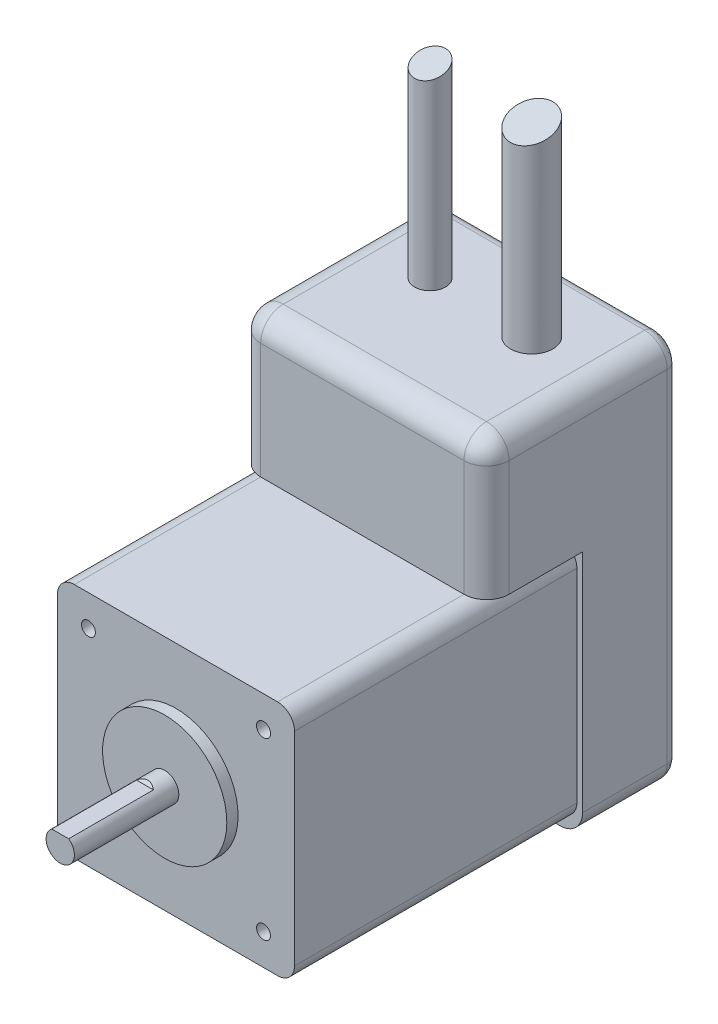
ISO-10303-21;
HEADER;
FILE_DESCRIPTION(('STEP AP214'),'2;1');
FILE_NAME('part.step','',(''),(''),'','','');
FILE_SCHEMA(('AUTOMOTIVE_DESIGN { 1 0 10303 214 1 1 1 1 }'));
ENDSEC;
DATA;
#1=APPLICATION_CONTEXT('core data for automotive mechanical design processes');
#2=APPLICATION_PROTOCOL_DEFINITION('international standard','automotive_design',2000,#1);
#3=PRODUCT_CONTEXT('',#1,'mechanical');
#4=PRODUCT('Part','Part','',(#3));
#5=PRODUCT_RELATED_PRODUCT_CATEGORY('part','',(#4));
#6=PRODUCT_DEFINITION_FORMATION('','',#4);
#7=PRODUCT_DEFINITION_CONTEXT('part definition',#1,'design');
#8=PRODUCT_DEFINITION('design','',#6,#7);
#9=PRODUCT_DEFINITION_SHAPE('','',#8);
#10=(LENGTH_UNIT() NAMED_UNIT(*) SI_UNIT(.MILLI.,.METRE.));
#11=(NAMED_UNIT(*) PLANE_ANGLE_UNIT() SI_UNIT($,.RADIAN.));
#12=(NAMED_UNIT(*) SI_UNIT($,.STERADIAN.) SOLID_ANGLE_UNIT());
#13=UNCERTAINTY_MEASURE_WITH_UNIT(LENGTH_MEASURE(1.E-05),#10,'distance_accuracy_value','');
#14=(GEOMETRIC_REPRESENTATION_CONTEXT(3) GLOBAL_UNCERTAINTY_ASSIGNED_CONTEXT((#13)) GLOBAL_UNIT_ASSIGNED_CONTEXT((#10,
#11,#12)) REPRESENTATION_CONTEXT('',''));
#15=CARTESIAN_POINT('',(0.,0.,0.));
#16=DIRECTION('',(0.,0.,1.));
#17=DIRECTION('',(1.,0.,0.));
#18=AXIS2_PLACEMENT_3D('',#15,#16,#17);
#19=CARTESIAN_POINT('',(3.5,2.,5.5));
#20=DIRECTION('',(0.,-0.707106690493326,-0.707106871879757));
#21=DIRECTION('',(0.,0.707106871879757,-0.707106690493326));
#22=AXIS2_PLACEMENT_3D('',#19,#20,#21);
#23=PLANE('',#22);
#24=DIRECTION('',(1.,0.,0.));
#25=VECTOR('',#24,1.);
#26=CARTESIAN_POINT('',(3.5,2.,5.5));
#27=LINE('',#26,#25);
#28=CARTESIAN_POINT('',(-1.5,2.,5.5));
#29=VERTEX_POINT('',#28);
#30=CARTESIAN_POINT('',(1.5,2.,5.5));
#31=VERTEX_POINT('',#30);
#32=EDGE_CURVE('E199',#29,#31,#27,.T.);
#33=ORIENTED_EDGE('',*,*,#32,.T.);
#34=CARTESIAN_POINT('',(0.,0.,7.49999948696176));
#35=DIRECTION('',(0.,-0.707106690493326,-0.707106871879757));
#36=DIRECTION('',(0.,-0.707106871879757,0.707106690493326));
#37=AXIS2_PLACEMENT_3D('',#34,#35,#36);
#38=ELLIPSE('',#37,3.53553345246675,2.5);
#39=EDGE_CURVE('E20',#29,#31,#38,.T.);
#40=ORIENTED_EDGE('',*,*,#39,.F.);
#41=EDGE_LOOP('',(#33,#40));
#42=FACE_BOUND('',#41,.T.);
#43=ADVANCED_FACE('F17',(#42),#23,.F.);
#44=CARTESIAN_POINT('',(3.5,2.,20.5));
#45=DIRECTION('',(0.,-1.,0.));
#46=DIRECTION('',(0.,0.,-1.));
#47=AXIS2_PLACEMENT_3D('',#44,#45,#46);
#48=PLANE('',#47);
#49=ORIENTED_EDGE('',*,*,#32,.F.);
#50=DIRECTION('',(0.,0.,1.));
#51=VECTOR('',#50,1.);
#52=CARTESIAN_POINT('',(-1.5,2.,2.));
#53=LINE('',#52,#51);
#54=CARTESIAN_POINT('',(-1.5,2.,20.5));
#55=VERTEX_POINT('',#54);
#56=EDGE_CURVE('E209',#55,#29,#53,.F.);
#57=ORIENTED_EDGE('',*,*,#56,.F.);
#58=DIRECTION('',(1.,0.,0.));
#59=VECTOR('',#58,1.);
#60=CARTESIAN_POINT('',(0.,2.,20.5));
#61=LINE('',#60,#59);
#62=CARTESIAN_POINT('',(1.5,2.,20.5));
#63=VERTEX_POINT('',#62);
#64=EDGE_CURVE('E211',#63,#55,#61,.F.);
#65=ORIENTED_EDGE('',*,*,#64,.F.);
#66=DIRECTION('',(0.,0.,1.));
#67=VECTOR('',#66,1.);
#68=CARTESIAN_POINT('',(1.5,2.,2.));
#69=LINE('',#68,#67);
#70=EDGE_CURVE('E207',#31,#63,#69,.T.);
#71=ORIENTED_EDGE('',*,*,#70,.F.);
#72=EDGE_LOOP('',(#49,#57,#65,#71));
#73=FACE_BOUND('',#72,.T.);
#74=ADVANCED_FACE('F213',(#73),#48,.F.);
#75=CARTESIAN_POINT('',(0.,0.,20.5));
#76=DIRECTION('',(0.,0.,1.));
#77=DIRECTION('',(1.,0.,0.));
#78=AXIS2_PLACEMENT_3D('',#75,#76,#77);
#79=PLANE('',#78);
#80=ORIENTED_EDGE('',*,*,#64,.T.);
#81=CARTESIAN_POINT('',(0.,0.,20.5));
#82=DIRECTION('',(0.,0.,1.));
#83=DIRECTION('',(1.,0.,0.));
#84=AXIS2_PLACEMENT_3D('',#81,#82,#83);
#85=CIRCLE('',#84,2.5);
#86=EDGE_CURVE('E215',#63,#55,#85,.F.);
#87=ORIENTED_EDGE('',*,*,#86,.F.);
#88=EDGE_LOOP('',(#80,#87));
#89=FACE_BOUND('',#88,.T.);
#90=ADVANCED_FACE('F313',(#89),#79,.T.);
#91=CARTESIAN_POINT('',(0.,0.,2.));
#92=DIRECTION('',(0.,0.,1.));
#93=DIRECTION('',(1.,0.,0.));
#94=AXIS2_PLACEMENT_3D('',#91,#92,#93);
#95=CYLINDRICAL_SURFACE('',#94,2.5);
#96=ORIENTED_EDGE('',*,*,#70,.T.);
#97=ORIENTED_EDGE('',*,*,#86,.T.);
#98=ORIENTED_EDGE('',*,*,#56,.T.);
#99=ORIENTED_EDGE('',*,*,#39,.T.);
#100=EDGE_LOOP('',(#96,#97,#98,#99));
#101=FACE_BOUND('',#100,.T.);
#102=CARTESIAN_POINT('',(0.,0.,2.));
#103=DIRECTION('',(0.,0.,1.));
#104=DIRECTION('',(1.,0.,0.));
#105=AXIS2_PLACEMENT_3D('',#102,#103,#104);
#106=CIRCLE('',#105,2.5);
#107=CARTESIAN_POINT('',(2.5,0.,2.));
#108=VERTEX_POINT('',#107);
#109=EDGE_CURVE('E217',#108,#108,#106,.F.);
#110=ORIENTED_EDGE('',*,*,#109,.F.);
#111=EDGE_LOOP('',(#110));
#112=FACE_BOUND('',#111,.T.);
#113=ADVANCED_FACE('F204',(#101,#112),#95,.T.);
#114=CARTESIAN_POINT('',(0.,0.,2.));
#115=DIRECTION('',(0.,0.,1.));
#116=DIRECTION('',(1.,0.,0.));
#117=AXIS2_PLACEMENT_3D('',#114,#115,#116);
#118=PLANE('',#117);
#119=CARTESIAN_POINT('',(0.,0.,2.));
#120=DIRECTION('',(0.,0.,1.));
#121=DIRECTION('',(1.,0.,0.));
#122=AXIS2_PLACEMENT_3D('',#119,#120,#121);
#123=CIRCLE('',#122,11.);
#124=CARTESIAN_POINT('',(11.,0.,2.));
#125=VERTEX_POINT('',#124);
#126=EDGE_CURVE('E304',#125,#125,#123,.F.);
#127=ORIENTED_EDGE('',*,*,#126,.F.);
#128=EDGE_LOOP('',(#127));
#129=FACE_BOUND('',#128,.T.);
#130=ORIENTED_EDGE('',*,*,#109,.T.);
#131=EDGE_LOOP('',(#130));
#132=FACE_BOUND('',#131,.T.);
#133=ADVANCED_FACE('F311',(#129,#132),#118,.T.);
#134=CARTESIAN_POINT('',(-15.5,15.5,-4.99999999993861));
#135=DIRECTION('',(0.,0.,1.));
#136=DIRECTION('',(1.,0.,0.));
#137=AXIS2_PLACEMENT_3D('',#134,#135,#136);
#138=CONICAL_SURFACE('',#137,1.22949999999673,1.02974425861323);
#139=CARTESIAN_POINT('',(-15.5,15.4999999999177,-5.73875813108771));
#140=VERTEX_POINT('',#139);
#141=VERTEX_LOOP('',#140);
#142=FACE_BOUND('',#141,.T.);
#143=CARTESIAN_POINT('',(-15.5,15.5,-5.));
#144=DIRECTION('',(0.,0.,-1.));
#145=DIRECTION('',(-1.,0.,0.));
#146=AXIS2_PLACEMENT_3D('',#143,#144,#145);
#147=CIRCLE('',#146,1.2295);
#148=CARTESIAN_POINT('',(-16.7295,15.5,-5.));
#149=VERTEX_POINT('',#148);
#150=EDGE_CURVE('E307',#149,#149,#147,.F.);
#151=ORIENTED_EDGE('',*,*,#150,.T.);
#152=EDGE_LOOP('',(#151));
#153=FACE_BOUND('',#152,.T.);
#154=ADVANCED_FACE('F320',(#142,#153),#138,.F.);
#155=CARTESIAN_POINT('',(-15.5,-15.5,-4.99999999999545));
#156=DIRECTION('',(0.,0.,1.));
#157=DIRECTION('',(1.,0.,0.));
#158=AXIS2_PLACEMENT_3D('',#155,#156,#157);
#159=CONICAL_SURFACE('',#158,1.22949999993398,1.02974425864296);
#160=CARTESIAN_POINT('',(-15.5,-15.5000000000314,-5.73875813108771));
#161=VERTEX_POINT('',#160);
#162=VERTEX_LOOP('',#161);
#163=FACE_BOUND('',#162,.T.);
#164=CARTESIAN_POINT('',(-15.5,-15.5,-5.));
#165=DIRECTION('',(0.,0.,-1.));
#166=DIRECTION('',(-1.,0.,0.));
#167=AXIS2_PLACEMENT_3D('',#164,#165,#166);
#168=CIRCLE('',#167,1.2295);
#169=CARTESIAN_POINT('',(-16.7295,-15.5,-5.));
#170=VERTEX_POINT('',#169);
#171=EDGE_CURVE('E680',#170,#170,#168,.F.);
#172=ORIENTED_EDGE('',*,*,#171,.T.);
#173=EDGE_LOOP('',(#172));
#174=FACE_BOUND('',#173,.T.);
#175=ADVANCED_FACE('F715',(#163,#174),#159,.F.);
#176=CARTESIAN_POINT('',(15.5,-15.5,-4.99999999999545));
#177=DIRECTION('',(0.,0.,1.));
#178=DIRECTION('',(1.,0.,0.));
#179=AXIS2_PLACEMENT_3D('',#176,#177,#178);
#180=CONICAL_SURFACE('',#179,1.22949999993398,1.02974425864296);
#181=CARTESIAN_POINT('',(15.5,-15.5000000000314,-5.73875813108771));
#182=VERTEX_POINT('',#181);
#183=VERTEX_LOOP('',#182);
#184=FACE_BOUND('',#183,.T.);
#185=CARTESIAN_POINT('',(15.5,-15.5,-5.));
#186=DIRECTION('',(0.,0.,-1.));
#187=DIRECTION('',(-1.,0.,0.));
#188=AXIS2_PLACEMENT_3D('',#185,#186,#187);
#189=CIRCLE('',#188,1.2295);
#190=CARTESIAN_POINT('',(14.2705,-15.5,-5.));
#191=VERTEX_POINT('',#190);
#192=EDGE_CURVE('E675',#191,#191,#189,.F.);
#193=ORIENTED_EDGE('',*,*,#192,.T.);
#194=EDGE_LOOP('',(#193));
#195=FACE_BOUND('',#194,.T.);
#196=ADVANCED_FACE('F711',(#184,#195),#180,.F.);
#197=CARTESIAN_POINT('',(15.5,15.5,-4.99999999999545));
#198=DIRECTION('',(0.,0.,1.));
#199=DIRECTION('',(1.,0.,0.));
#200=AXIS2_PLACEMENT_3D('',#197,#198,#199);
#201=CONICAL_SURFACE('',#200,1.25000000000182,1.02974425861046);
#202=CARTESIAN_POINT('',(15.5,15.4999999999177,-5.75107577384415));
#203=VERTEX_POINT('',#202);
#204=VERTEX_LOOP('',#203);
#205=FACE_BOUND('',#204,.T.);
#206=CARTESIAN_POINT('',(15.5,15.5,-5.));
#207=DIRECTION('',(0.,0.,-1.));
#208=DIRECTION('',(-1.,0.,0.));
#209=AXIS2_PLACEMENT_3D('',#206,#207,#208);
#210=CIRCLE('',#209,1.25);
#211=CARTESIAN_POINT('',(14.25,15.5,-5.));
#212=VERTEX_POINT('',#211);
#213=EDGE_CURVE('E303',#212,#212,#210,.F.);
#214=ORIENTED_EDGE('',*,*,#213,.T.);
#215=EDGE_LOOP('',(#214));
#216=FACE_BOUND('',#215,.T.);
#217=ADVANCED_FACE('F703',(#205,#216),#201,.F.);
#218=CARTESIAN_POINT('',(0.,0.,0.));
#219=DIRECTION('',(0.,0.,1.));
#220=DIRECTION('',(1.,0.,0.));
#221=AXIS2_PLACEMENT_3D('',#218,#219,#220);
#222=CYLINDRICAL_SURFACE('',#221,11.);
#223=CARTESIAN_POINT('',(0.,0.,0.));
#224=DIRECTION('',(0.,0.,1.));
#225=DIRECTION('',(1.,0.,0.));
#226=AXIS2_PLACEMENT_3D('',#223,#224,#225);
#227=CIRCLE('',#226,11.);
#228=CARTESIAN_POINT('',(11.,0.,0.));
#229=VERTEX_POINT('',#228);
#230=EDGE_CURVE('E300',#229,#229,#227,.F.);
#231=ORIENTED_EDGE('',*,*,#230,.F.);
#232=EDGE_LOOP('',(#231));
#233=FACE_BOUND('',#232,.T.);
#234=ORIENTED_EDGE('',*,*,#126,.T.);
#235=EDGE_LOOP('',(#234));
#236=FACE_BOUND('',#235,.T.);
#237=ADVANCED_FACE('F693',(#233,#236),#222,.T.);
#238=CARTESIAN_POINT('',(-15.5,15.5,0.));
#239=DIRECTION('',(0.,0.,-1.));
#240=DIRECTION('',(-1.,0.,0.));
#241=AXIS2_PLACEMENT_3D('',#238,#239,#240);
#242=CYLINDRICAL_SURFACE('',#241,1.2295);
#243=CARTESIAN_POINT('',(-15.5,15.5,0.));
#244=DIRECTION('',(0.,0.,-1.));
#245=DIRECTION('',(-1.,0.,0.));
#246=AXIS2_PLACEMENT_3D('',#243,#244,#245);
#247=CIRCLE('',#246,1.2295);
#248=CARTESIAN_POINT('',(-16.7295,15.5,0.));
#249=VERTEX_POINT('',#248);
#250=EDGE_CURVE('E297',#249,#249,#247,.T.);
#251=ORIENTED_EDGE('',*,*,#250,.F.);
#252=EDGE_LOOP('',(#251));
#253=FACE_BOUND('',#252,.T.);
#254=ORIENTED_EDGE('',*,*,#150,.F.);
#255=EDGE_LOOP('',(#254));
#256=FACE_BOUND('',#255,.T.);
#257=ADVANCED_FACE('F690',(#253,#256),#242,.F.);
#258=CARTESIAN_POINT('',(-15.5,-15.5,0.));
#259=DIRECTION('',(0.,0.,-1.));
#260=DIRECTION('',(-1.,0.,0.));
#261=AXIS2_PLACEMENT_3D('',#258,#259,#260);
#262=CYLINDRICAL_SURFACE('',#261,1.2295);
#263=CARTESIAN_POINT('',(-15.5,-15.5,0.));
#264=DIRECTION('',(0.,0.,-1.));
#265=DIRECTION('',(-1.,0.,0.));
#266=AXIS2_PLACEMENT_3D('',#263,#264,#265);
#267=CIRCLE('',#266,1.2295);
#268=CARTESIAN_POINT('',(-16.7295,-15.5,0.));
#269=VERTEX_POINT('',#268);
#270=EDGE_CURVE('E294',#269,#269,#267,.T.);
#271=ORIENTED_EDGE('',*,*,#270,.F.);
#272=EDGE_LOOP('',(#271));
#273=FACE_BOUND('',#272,.T.);
#274=ORIENTED_EDGE('',*,*,#171,.F.);
#275=EDGE_LOOP('',(#274));
#276=FACE_BOUND('',#275,.T.);
#277=ADVANCED_FACE('F692',(#273,#276),#262,.F.);
#278=CARTESIAN_POINT('',(15.5,-15.5,0.));
#279=DIRECTION('',(0.,0.,-1.));
#280=DIRECTION('',(-1.,0.,0.));
#281=AXIS2_PLACEMENT_3D('',#278,#279,#280);
#282=CYLINDRICAL_SURFACE('',#281,1.2295);
#283=CARTESIAN_POINT('',(15.5,-15.5,0.));
#284=DIRECTION('',(0.,0.,-1.));
#285=DIRECTION('',(-1.,0.,0.));
#286=AXIS2_PLACEMENT_3D('',#283,#284,#285);
#287=CIRCLE('',#286,1.2295);
#288=CARTESIAN_POINT('',(14.2705,-15.5,0.));
#289=VERTEX_POINT('',#288);
#290=EDGE_CURVE('E291',#289,#289,#287,.T.);
#291=ORIENTED_EDGE('',*,*,#290,.F.);
#292=EDGE_LOOP('',(#291));
#293=FACE_BOUND('',#292,.T.);
#294=ORIENTED_EDGE('',*,*,#192,.F.);
#295=EDGE_LOOP('',(#294));
#296=FACE_BOUND('',#295,.T.);
#297=ADVANCED_FACE('F700',(#293,#296),#282,.F.);
#298=CARTESIAN_POINT('',(15.5,15.5,0.));
#299=DIRECTION('',(0.,0.,-1.));
#300=DIRECTION('',(-1.,0.,0.));
#301=AXIS2_PLACEMENT_3D('',#298,#299,#300);
#302=CYLINDRICAL_SURFACE('',#301,1.25);
#303=CARTESIAN_POINT('',(15.5,15.5,0.));
#304=DIRECTION('',(0.,0.,-1.));
#305=DIRECTION('',(-1.,0.,0.));
#306=AXIS2_PLACEMENT_3D('',#303,#304,#305);
#307=CIRCLE('',#306,1.25);
#308=CARTESIAN_POINT('',(14.25,15.5,0.));
#309=VERTEX_POINT('',#308);
#310=EDGE_CURVE('E287',#309,#309,#307,.T.);
#311=ORIENTED_EDGE('',*,*,#310,.F.);
#312=EDGE_LOOP('',(#311));
#313=FACE_BOUND('',#312,.T.);
#314=ORIENTED_EDGE('',*,*,#213,.F.);
#315=EDGE_LOOP('',(#314));
#316=FACE_BOUND('',#315,.T.);
#317=ADVANCED_FACE('F760',(#313,#316),#302,.F.);
#318=CARTESIAN_POINT('',(0.,0.,0.));
#319=DIRECTION('',(0.,0.,1.));
#320=DIRECTION('',(1.,0.,0.));
#321=AXIS2_PLACEMENT_3D('',#318,#319,#320);
#322=PLANE('',#321);
#323=DIRECTION('',(1.,0.,0.));
#324=VECTOR('',#323,1.);
#325=CARTESIAN_POINT('',(18.,21.,0.));
#326=LINE('',#325,#324);
#327=CARTESIAN_POINT('',(-18.,21.,0.));
#328=VERTEX_POINT('',#327);
#329=CARTESIAN_POINT('',(18.,21.,0.));
#330=VERTEX_POINT('',#329);
#331=EDGE_CURVE('E290',#328,#330,#326,.T.);
#332=ORIENTED_EDGE('',*,*,#331,.F.);
#333=CARTESIAN_POINT('',(-18.,18.,0.));
#334=DIRECTION('',(0.,0.,-1.));
#335=DIRECTION('',(-1.,0.,0.));
#336=AXIS2_PLACEMENT_3D('',#333,#334,#335);
#337=CIRCLE('',#336,3.);
#338=CARTESIAN_POINT('',(-21.,18.,0.));
#339=VERTEX_POINT('',#338);
#340=EDGE_CURVE('E271',#339,#328,#337,.T.);
#341=ORIENTED_EDGE('',*,*,#340,.F.);
#342=DIRECTION('',(0.,1.,0.));
#343=VECTOR('',#342,1.);
#344=CARTESIAN_POINT('',(-21.,18.,0.));
#345=LINE('',#344,#343);
#346=CARTESIAN_POINT('',(-21.,-18.,0.));
#347=VERTEX_POINT('',#346);
#348=EDGE_CURVE('E648',#347,#339,#345,.T.);
#349=ORIENTED_EDGE('',*,*,#348,.F.);
#350=CARTESIAN_POINT('',(-18.,-18.,0.));
#351=DIRECTION('',(0.,0.,-1.));
#352=DIRECTION('',(-1.,0.,0.));
#353=AXIS2_PLACEMENT_3D('',#350,#351,#352);
#354=CIRCLE('',#353,3.);
#355=CARTESIAN_POINT('',(-18.,-21.,0.));
#356=VERTEX_POINT('',#355);
#357=EDGE_CURVE('E275',#356,#347,#354,.T.);
#358=ORIENTED_EDGE('',*,*,#357,.F.);
#359=DIRECTION('',(1.,0.,0.));
#360=VECTOR('',#359,1.);
#361=CARTESIAN_POINT('',(-18.,-21.,0.));
#362=LINE('',#361,#360);
#363=CARTESIAN_POINT('',(18.,-21.,0.));
#364=VERTEX_POINT('',#363);
#365=EDGE_CURVE('E653',#364,#356,#362,.F.);
#366=ORIENTED_EDGE('',*,*,#365,.F.);
#367=CARTESIAN_POINT('',(18.,-18.,0.));
#368=DIRECTION('',(0.,0.,-1.));
#369=DIRECTION('',(-1.,0.,0.));
#370=AXIS2_PLACEMENT_3D('',#367,#368,#369);
#371=CIRCLE('',#370,3.);
#372=CARTESIAN_POINT('',(21.,-18.,0.));
#373=VERTEX_POINT('',#372);
#374=EDGE_CURVE('E279',#373,#364,#371,.T.);
#375=ORIENTED_EDGE('',*,*,#374,.F.);
#376=DIRECTION('',(0.,1.,0.));
#377=VECTOR('',#376,1.);
#378=CARTESIAN_POINT('',(21.,-18.,0.));
#379=LINE('',#378,#377);
#380=CARTESIAN_POINT('',(21.,18.,0.));
#381=VERTEX_POINT('',#380);
#382=EDGE_CURVE('E658',#381,#373,#379,.F.);
#383=ORIENTED_EDGE('',*,*,#382,.F.);
#384=CARTESIAN_POINT('',(18.,18.,0.));
#385=DIRECTION('',(0.,0.,-1.));
#386=DIRECTION('',(-1.,0.,0.));
#387=AXIS2_PLACEMENT_3D('',#384,#385,#386);
#388=CIRCLE('',#387,3.);
#389=EDGE_CURVE('E283',#330,#381,#388,.T.);
#390=ORIENTED_EDGE('',*,*,#389,.F.);
#391=EDGE_LOOP('',(#332,#341,#349,#358,#366,#375,#383,#390));
#392=FACE_BOUND('',#391,.T.);
#393=ORIENTED_EDGE('',*,*,#310,.T.);
#394=EDGE_LOOP('',(#393));
#395=FACE_BOUND('',#394,.T.);
#396=ORIENTED_EDGE('',*,*,#290,.T.);
#397=EDGE_LOOP('',(#396));
#398=FACE_BOUND('',#397,.T.);
#399=ORIENTED_EDGE('',*,*,#270,.T.);
#400=EDGE_LOOP('',(#399));
#401=FACE_BOUND('',#400,.T.);
#402=ORIENTED_EDGE('',*,*,#250,.T.);
#403=EDGE_LOOP('',(#402));
#404=FACE_BOUND('',#403,.T.);
#405=ORIENTED_EDGE('',*,*,#230,.T.);
#406=EDGE_LOOP('',(#405));
#407=FACE_BOUND('',#406,.T.);
#408=ADVANCED_FACE('F767',(#392,#395,#398,#401,#404,#407),#322,.T.);
#409=CARTESIAN_POINT('',(18.,21.,0.));
#410=DIRECTION('',(0.,1.,0.));
#411=DIRECTION('',(0.,0.,1.));
#412=AXIS2_PLACEMENT_3D('',#409,#410,#411);
#413=PLANE('',#412);
#414=ORIENTED_EDGE('',*,*,#331,.T.);
#415=DIRECTION('',(0.,0.,-1.));
#416=VECTOR('',#415,1.);
#417=CARTESIAN_POINT('',(18.,21.,0.));
#418=LINE('',#417,#416);
#419=CARTESIAN_POINT('',(18.,21.,-33.));
#420=VERTEX_POINT('',#419);
#421=EDGE_CURVE('E286',#420,#330,#418,.F.);
#422=ORIENTED_EDGE('',*,*,#421,.F.);
#423=DIRECTION('',(1.,0.,0.));
#424=VECTOR('',#423,1.);
#425=CARTESIAN_POINT('',(0.,21.,-33.));
#426=LINE('',#425,#424);
#427=CARTESIAN_POINT('',(-18.,21.,-33.));
#428=VERTEX_POINT('',#427);
#429=EDGE_CURVE('E663',#428,#420,#426,.T.);
#430=ORIENTED_EDGE('',*,*,#429,.F.);
#431=DIRECTION('',(0.,0.,-1.));
#432=VECTOR('',#431,1.);
#433=CARTESIAN_POINT('',(-18.,21.,0.));
#434=LINE('',#433,#432);
#435=EDGE_CURVE('E273',#328,#428,#434,.T.);
#436=ORIENTED_EDGE('',*,*,#435,.F.);
#437=EDGE_LOOP('',(#414,#422,#430,#436));
#438=FACE_BOUND('',#437,.T.);
#439=ADVANCED_FACE('F775',(#438),#413,.T.);
#440=CARTESIAN_POINT('',(18.,18.,0.));
#441=DIRECTION('',(0.,0.,-1.));
#442=DIRECTION('',(-1.,0.,0.));
#443=AXIS2_PLACEMENT_3D('',#440,#441,#442);
#444=CYLINDRICAL_SURFACE('',#443,3.);
#445=ORIENTED_EDGE('',*,*,#389,.T.);
#446=DIRECTION('',(0.,0.,-1.));
#447=VECTOR('',#446,1.);
#448=CARTESIAN_POINT('',(21.,18.,0.));
#449=LINE('',#448,#447);
#450=CARTESIAN_POINT('',(21.,18.,-50.));
#451=VERTEX_POINT('',#450);
#452=EDGE_CURVE('E285',#451,#381,#449,.F.);
#453=ORIENTED_EDGE('',*,*,#452,.F.);
#454=CARTESIAN_POINT('',(18.,18.,-50.));
#455=DIRECTION('',(0.,0.,-1.));
#456=DIRECTION('',(-1.,0.,0.));
#457=AXIS2_PLACEMENT_3D('',#454,#455,#456);
#458=CIRCLE('',#457,3.);
#459=CARTESIAN_POINT('',(18.,21.,-50.));
#460=VERTEX_POINT('',#459);
#461=EDGE_CURVE('E258',#460,#451,#458,.T.);
#462=ORIENTED_EDGE('',*,*,#461,.F.);
#463=DIRECTION('',(0.,0.,-1.));
#464=VECTOR('',#463,1.);
#465=CARTESIAN_POINT('',(18.,21.,-50.));
#466=LINE('',#465,#464);
#467=EDGE_CURVE('E264',#420,#460,#466,.T.);
#468=ORIENTED_EDGE('',*,*,#467,.F.);
#469=ORIENTED_EDGE('',*,*,#421,.T.);
#470=EDGE_LOOP('',(#445,#453,#462,#468,#469));
#471=FACE_BOUND('',#470,.T.);
#472=ADVANCED_FACE('F783',(#471),#444,.T.);
#473=CARTESIAN_POINT('',(21.,-18.,0.));
#474=DIRECTION('',(1.,0.,0.));
#475=DIRECTION('',(0.,0.,-1.));
#476=AXIS2_PLACEMENT_3D('',#473,#474,#475);
#477=PLANE('',#476);
#478=ORIENTED_EDGE('',*,*,#382,.T.);
#479=DIRECTION('',(0.,0.,-1.));
#480=VECTOR('',#479,1.);
#481=CARTESIAN_POINT('',(21.,-18.,0.));
#482=LINE('',#481,#480);
#483=CARTESIAN_POINT('',(21.,-18.,-50.));
#484=VERTEX_POINT('',#483);
#485=EDGE_CURVE('E282',#484,#373,#482,.F.);
#486=ORIENTED_EDGE('',*,*,#485,.F.);
#487=DIRECTION('',(0.,1.,0.));
#488=VECTOR('',#487,1.);
#489=CARTESIAN_POINT('',(21.,11.25,-50.));
#490=LINE('',#489,#488);
#491=EDGE_CURVE('E257',#451,#484,#490,.F.);
#492=ORIENTED_EDGE('',*,*,#491,.F.);
#493=ORIENTED_EDGE('',*,*,#452,.T.);
#494=EDGE_LOOP('',(#478,#486,#492,#493));
#495=FACE_BOUND('',#494,.T.);
#496=ADVANCED_FACE('F791',(#495),#477,.T.);
#497=CARTESIAN_POINT('',(18.,-18.,0.));
#498=DIRECTION('',(0.,0.,-1.));
#499=DIRECTION('',(-1.,0.,0.));
#500=AXIS2_PLACEMENT_3D('',#497,#498,#499);
#501=CYLINDRICAL_SURFACE('',#500,3.);
#502=ORIENTED_EDGE('',*,*,#374,.T.);
#503=DIRECTION('',(0.,0.,-1.));
#504=VECTOR('',#503,1.);
#505=CARTESIAN_POINT('',(18.,-21.,0.));
#506=LINE('',#505,#504);
#507=CARTESIAN_POINT('',(18.,-21.,-50.));
#508=VERTEX_POINT('',#507);
#509=EDGE_CURVE('E281',#508,#364,#506,.F.);
#510=ORIENTED_EDGE('',*,*,#509,.F.);
#511=CARTESIAN_POINT('',(18.,-18.,-50.));
#512=DIRECTION('',(0.,0.,-1.));
#513=DIRECTION('',(-1.,0.,0.));
#514=AXIS2_PLACEMENT_3D('',#511,#512,#513);
#515=CIRCLE('',#514,3.);
#516=EDGE_CURVE('E255',#484,#508,#515,.T.);
#517=ORIENTED_EDGE('',*,*,#516,.F.);
#518=ORIENTED_EDGE('',*,*,#485,.T.);
#519=EDGE_LOOP('',(#502,#510,#517,#518));
#520=FACE_BOUND('',#519,.T.);
#521=ADVANCED_FACE('F799',(#520),#501,.T.);
#522=CARTESIAN_POINT('',(-18.,-21.,0.));
#523=DIRECTION('',(0.,-1.,0.));
#524=DIRECTION('',(0.,0.,-1.));
#525=AXIS2_PLACEMENT_3D('',#522,#523,#524);
#526=PLANE('',#525);
#527=ORIENTED_EDGE('',*,*,#365,.T.);
#528=DIRECTION('',(0.,0.,-1.));
#529=VECTOR('',#528,1.);
#530=CARTESIAN_POINT('',(-18.,-21.,0.));
#531=LINE('',#530,#529);
#532=CARTESIAN_POINT('',(-18.,-21.,-50.));
#533=VERTEX_POINT('',#532);
#534=EDGE_CURVE('E278',#533,#356,#531,.F.);
#535=ORIENTED_EDGE('',*,*,#534,.F.);
#536=DIRECTION('',(1.,0.,0.));
#537=VECTOR('',#536,1.);
#538=CARTESIAN_POINT('',(0.,-21.,-50.));
#539=LINE('',#538,#537);
#540=EDGE_CURVE('E254',#508,#533,#539,.F.);
#541=ORIENTED_EDGE('',*,*,#540,.F.);
#542=ORIENTED_EDGE('',*,*,#509,.T.);
#543=EDGE_LOOP('',(#527,#535,#541,#542));
#544=FACE_BOUND('',#543,.T.);
#545=ADVANCED_FACE('F807',(#544),#526,.T.);
#546=CARTESIAN_POINT('',(-18.,-18.,0.));
#547=DIRECTION('',(0.,0.,-1.));
#548=DIRECTION('',(-1.,0.,0.));
#549=AXIS2_PLACEMENT_3D('',#546,#547,#548);
#550=CYLINDRICAL_SURFACE('',#549,3.);
#551=ORIENTED_EDGE('',*,*,#357,.T.);
#552=DIRECTION('',(0.,0.,1.));
#553=VECTOR('',#552,1.);
#554=CARTESIAN_POINT('',(-21.,-18.,0.));
#555=LINE('',#554,#553);
#556=CARTESIAN_POINT('',(-21.,-18.,-50.));
#557=VERTEX_POINT('',#556);
#558=EDGE_CURVE('E277',#557,#347,#555,.T.);
#559=ORIENTED_EDGE('',*,*,#558,.F.);
#560=CARTESIAN_POINT('',(-18.,-18.,-50.));
#561=DIRECTION('',(0.,0.,-1.));
#562=DIRECTION('',(-1.,0.,0.));
#563=AXIS2_PLACEMENT_3D('',#560,#561,#562);
#564=CIRCLE('',#563,3.);
#565=EDGE_CURVE('E252',#533,#557,#564,.T.);
#566=ORIENTED_EDGE('',*,*,#565,.F.);
#567=ORIENTED_EDGE('',*,*,#534,.T.);
#568=EDGE_LOOP('',(#551,#559,#566,#567));
#569=FACE_BOUND('',#568,.T.);
#570=ADVANCED_FACE('F815',(#569),#550,.T.);
#571=CARTESIAN_POINT('',(-21.,18.,0.));
#572=DIRECTION('',(-1.,0.,0.));
#573=DIRECTION('',(0.,0.,1.));
#574=AXIS2_PLACEMENT_3D('',#571,#572,#573);
#575=PLANE('',#574);
#576=ORIENTED_EDGE('',*,*,#348,.T.);
#577=DIRECTION('',(0.,0.,-1.));
#578=VECTOR('',#577,1.);
#579=CARTESIAN_POINT('',(-21.,18.,0.));
#580=LINE('',#579,#578);
#581=CARTESIAN_POINT('',(-21.,18.,-50.));
#582=VERTEX_POINT('',#581);
#583=EDGE_CURVE('E274',#582,#339,#580,.F.);
#584=ORIENTED_EDGE('',*,*,#583,.F.);
#585=DIRECTION('',(0.,1.,0.));
#586=VECTOR('',#585,1.);
#587=CARTESIAN_POINT('',(-21.,11.25,-50.));
#588=LINE('',#587,#586);
#589=EDGE_CURVE('E251',#557,#582,#588,.T.);
#590=ORIENTED_EDGE('',*,*,#589,.F.);
#591=ORIENTED_EDGE('',*,*,#558,.T.);
#592=EDGE_LOOP('',(#576,#584,#590,#591));
#593=FACE_BOUND('',#592,.T.);
#594=ADVANCED_FACE('F823',(#593),#575,.T.);
#595=CARTESIAN_POINT('',(-18.,18.,0.));
#596=DIRECTION('',(0.,0.,-1.));
#597=DIRECTION('',(-1.,0.,0.));
#598=AXIS2_PLACEMENT_3D('',#595,#596,#597);
#599=CYLINDRICAL_SURFACE('',#598,3.);
#600=ORIENTED_EDGE('',*,*,#435,.T.);
#601=DIRECTION('',(0.,0.,-1.));
#602=VECTOR('',#601,1.);
#603=CARTESIAN_POINT('',(-18.,21.,-50.));
#604=LINE('',#603,#602);
#605=CARTESIAN_POINT('',(-18.,21.,-50.));
#606=VERTEX_POINT('',#605);
#607=EDGE_CURVE('E270',#606,#428,#604,.F.);
#608=ORIENTED_EDGE('',*,*,#607,.F.);
#609=CARTESIAN_POINT('',(-18.,18.,-50.));
#610=DIRECTION('',(0.,0.,-1.));
#611=DIRECTION('',(-1.,0.,0.));
#612=AXIS2_PLACEMENT_3D('',#609,#610,#611);
#613=CIRCLE('',#612,3.);
#614=EDGE_CURVE('E248',#582,#606,#613,.T.);
#615=ORIENTED_EDGE('',*,*,#614,.F.);
#616=ORIENTED_EDGE('',*,*,#583,.T.);
#617=ORIENTED_EDGE('',*,*,#340,.T.);
#618=EDGE_LOOP('',(#600,#608,#615,#616,#617));
#619=FACE_BOUND('',#618,.T.);
#620=ADVANCED_FACE('F831',(#619),#599,.T.);
#621=CARTESIAN_POINT('',(0.,33.25,-33.));
#622=DIRECTION('',(0.,0.,1.));
#623=DIRECTION('',(1.,0.,0.));
#624=AXIS2_PLACEMENT_3D('',#621,#622,#623);
#625=PLANE('',#624);
#626=DIRECTION('',(0.,1.,0.));
#627=VECTOR('',#626,1.);
#628=CARTESIAN_POINT('',(-18.,37.375,-33.));
#629=LINE('',#628,#627);
#630=CARTESIAN_POINT('',(-18.,41.5,-33.));
#631=VERTEX_POINT('',#630);
#632=EDGE_CURVE('E269',#428,#631,#629,.T.);
#633=ORIENTED_EDGE('',*,*,#632,.F.);
#634=ORIENTED_EDGE('',*,*,#429,.T.);
#635=DIRECTION('',(0.,-1.,0.));
#636=VECTOR('',#635,1.);
#637=CARTESIAN_POINT('',(18.,7.125,-33.));
#638=LINE('',#637,#636);
#639=CARTESIAN_POINT('',(18.,41.5,-33.));
#640=VERTEX_POINT('',#639);
#641=EDGE_CURVE('E265',#640,#420,#638,.T.);
#642=ORIENTED_EDGE('',*,*,#641,.F.);
#643=DIRECTION('',(1.,0.,0.));
#644=VECTOR('',#643,1.);
#645=CARTESIAN_POINT('',(9.,41.5,-33.));
#646=LINE('',#645,#644);
#647=EDGE_CURVE('E247',#631,#640,#646,.T.);
#648=ORIENTED_EDGE('',*,*,#647,.F.);
#649=EDGE_LOOP('',(#633,#634,#642,#648));
#650=FACE_BOUND('',#649,.T.);
#651=ADVANCED_FACE('F839',(#650),#625,.T.);
#652=CARTESIAN_POINT('',(-14.,80.9445648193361,-61.5566444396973));
#653=DIRECTION('',(0.,-0.948683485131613,-0.316227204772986));
#654=DIRECTION('',(0.,0.316227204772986,-0.948683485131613));
#655=AXIS2_PLACEMENT_3D('',#652,#653,#654);
#656=PLANE('',#655);
#657=CARTESIAN_POINT('',(-9.00000000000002,78.4256883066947,-54.));
#658=DIRECTION('',(0.,-0.948683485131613,-0.316227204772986));
#659=DIRECTION('',(0.,0.316227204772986,-0.948683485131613));
#660=AXIS2_PLACEMENT_3D('',#657,#658,#659);
#661=ELLIPSE('',#660,2.89875395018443,2.75);
#662=CARTESIAN_POINT('',(-9.00000000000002,79.3423531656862,-56.75));
#663=VERTEX_POINT('',#662);
#664=EDGE_CURVE('E244',#663,#663,#661,.T.);
#665=ORIENTED_EDGE('',*,*,#664,.F.);
#666=EDGE_LOOP('',(#665));
#667=FACE_BOUND('',#666,.T.);
#668=ADVANCED_FACE('F847',(#667),#656,.F.);
#669=CARTESIAN_POINT('',(-14.,80.9445648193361,-61.5566444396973));
#670=DIRECTION('',(0.,-0.948683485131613,-0.316227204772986));
#671=DIRECTION('',(0.,0.316227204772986,-0.948683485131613));
#672=AXIS2_PLACEMENT_3D('',#669,#670,#671);
#673=PLANE('',#672);
#674=CARTESIAN_POINT('',(8.99999999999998,78.4256883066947,-54.));
#675=DIRECTION('',(0.,-0.948683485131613,-0.316227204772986));
#676=DIRECTION('',(0.,0.316227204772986,-0.948683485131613));
#677=AXIS2_PLACEMENT_3D('',#674,#675,#676);
#678=ELLIPSE('',#677,3.95284629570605,3.75);
#679=CARTESIAN_POINT('',(8.99999999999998,79.6756858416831,-57.75));
#680=VERTEX_POINT('',#679);
#681=EDGE_CURVE('E240',#680,#680,#678,.T.);
#682=ORIENTED_EDGE('',*,*,#681,.F.);
#683=EDGE_LOOP('',(#682));
#684=FACE_BOUND('',#683,.T.);
#685=ADVANCED_FACE('F629',(#684),#673,.F.);
#686=CARTESIAN_POINT('',(-18.,41.5,-37.));
#687=DIRECTION('',(1.,0.,0.));
#688=DIRECTION('',(0.,1.,0.));
#689=AXIS2_PLACEMENT_3D('',#686,#687,#688);
#690=SPHERICAL_SURFACE('',#689,4.);
#691=CARTESIAN_POINT('',(-18.,41.5,-37.));
#692=DIRECTION('',(1.,0.,0.));
#693=DIRECTION('',(0.,1.,0.));
#694=AXIS2_PLACEMENT_3D('',#691,#692,#693);
#695=CIRCLE('',#694,4.);
#696=CARTESIAN_POINT('',(-18.,45.5,-37.));
#697=VERTEX_POINT('',#696);
#698=EDGE_CURVE('E572',#697,#631,#695,.T.);
#699=ORIENTED_EDGE('',*,*,#698,.F.);
#700=CARTESIAN_POINT('',(-18.,41.5,-37.));
#701=DIRECTION('',(0.,0.,-1.));
#702=DIRECTION('',(-1.,0.,0.));
#703=AXIS2_PLACEMENT_3D('',#700,#701,#702);
#704=CIRCLE('',#703,4.);
#705=CARTESIAN_POINT('',(-22.,41.5,-37.));
#706=VERTEX_POINT('',#705);
#707=EDGE_CURVE('E243',#706,#697,#704,.T.);
#708=ORIENTED_EDGE('',*,*,#707,.F.);
#709=CARTESIAN_POINT('',(-18.,41.5,-37.));
#710=DIRECTION('',(0.,1.,0.));
#711=DIRECTION('',(-1.,0.,0.));
#712=AXIS2_PLACEMENT_3D('',#709,#710,#711);
#713=CIRCLE('',#712,4.);
#714=EDGE_CURVE('E643',#631,#706,#713,.F.);
#715=ORIENTED_EDGE('',*,*,#714,.F.);
#716=EDGE_LOOP('',(#699,#708,#715));
#717=FACE_BOUND('',#716,.T.);
#718=ADVANCED_FACE('F624',(#717),#690,.T.);
#719=CARTESIAN_POINT('',(22.,21.,-50.));
#720=DIRECTION('',(0.,-1.,0.));
#721=DIRECTION('',(0.,0.,-1.));
#722=AXIS2_PLACEMENT_3D('',#719,#720,#721);
#723=PLANE('',#722);
#724=DIRECTION('',(1.,0.,0.));
#725=VECTOR('',#724,1.);
#726=CARTESIAN_POINT('',(0.,21.,-50.));
#727=LINE('',#726,#725);
#728=CARTESIAN_POINT('',(-22.,21.,-50.));
#729=VERTEX_POINT('',#728);
#730=EDGE_CURVE('E250',#606,#729,#727,.F.);
#731=ORIENTED_EDGE('',*,*,#730,.F.);
#732=ORIENTED_EDGE('',*,*,#607,.T.);
#733=CARTESIAN_POINT('',(-18.,21.,-37.));
#734=DIRECTION('',(0.,1.,0.));
#735=DIRECTION('',(-1.,0.,0.));
#736=AXIS2_PLACEMENT_3D('',#733,#734,#735);
#737=CIRCLE('',#736,4.);
#738=CARTESIAN_POINT('',(-22.,21.,-37.));
#739=VERTEX_POINT('',#738);
#740=EDGE_CURVE('E266',#739,#428,#737,.T.);
#741=ORIENTED_EDGE('',*,*,#740,.F.);
#742=DIRECTION('',(0.,0.,1.));
#743=VECTOR('',#742,1.);
#744=CARTESIAN_POINT('',(-22.,21.,-50.));
#745=LINE('',#744,#743);
#746=EDGE_CURVE('E1082',#729,#739,#745,.T.);
#747=ORIENTED_EDGE('',*,*,#746,.F.);
#748=EDGE_LOOP('',(#731,#732,#741,#747));
#749=FACE_BOUND('',#748,.T.);
#750=ADVANCED_FACE('F620',(#749),#723,.T.);
#751=CARTESIAN_POINT('',(-18.,37.375,-37.));
#752=DIRECTION('',(0.,1.,0.));
#753=DIRECTION('',(-1.,0.,0.));
#754=AXIS2_PLACEMENT_3D('',#751,#752,#753);
#755=CYLINDRICAL_SURFACE('',#754,4.);
#756=ORIENTED_EDGE('',*,*,#714,.T.);
#757=DIRECTION('',(0.,-1.,0.));
#758=VECTOR('',#757,1.);
#759=CARTESIAN_POINT('',(-22.,41.5,-37.));
#760=LINE('',#759,#758);
#761=EDGE_CURVE('E239',#739,#706,#760,.F.);
#762=ORIENTED_EDGE('',*,*,#761,.F.);
#763=ORIENTED_EDGE('',*,*,#740,.T.);
#764=ORIENTED_EDGE('',*,*,#632,.T.);
#765=EDGE_LOOP('',(#756,#762,#763,#764));
#766=FACE_BOUND('',#765,.T.);
#767=ADVANCED_FACE('F616',(#766),#755,.T.);
#768=CARTESIAN_POINT('',(18.,7.125,-37.));
#769=DIRECTION('',(0.,-1.,0.));
#770=DIRECTION('',(1.,0.,0.));
#771=AXIS2_PLACEMENT_3D('',#768,#769,#770);
#772=CYLINDRICAL_SURFACE('',#771,4.);
#773=CARTESIAN_POINT('',(18.,41.5,-37.));
#774=DIRECTION('',(0.,-1.,0.));
#775=DIRECTION('',(1.,0.,0.));
#776=AXIS2_PLACEMENT_3D('',#773,#774,#775);
#777=CIRCLE('',#776,4.);
#778=CARTESIAN_POINT('',(22.,41.5,-37.));
#779=VERTEX_POINT('',#778);
#780=EDGE_CURVE('E587',#640,#779,#777,.F.);
#781=ORIENTED_EDGE('',*,*,#780,.F.);
#782=ORIENTED_EDGE('',*,*,#641,.T.);
#783=CARTESIAN_POINT('',(18.,21.,-37.));
#784=DIRECTION('',(0.,-1.,0.));
#785=DIRECTION('',(1.,0.,0.));
#786=AXIS2_PLACEMENT_3D('',#783,#784,#785);
#787=CIRCLE('',#786,4.);
#788=CARTESIAN_POINT('',(22.,21.,-37.));
#789=VERTEX_POINT('',#788);
#790=EDGE_CURVE('E261',#789,#420,#787,.T.);
#791=ORIENTED_EDGE('',*,*,#790,.F.);
#792=DIRECTION('',(0.,1.,0.));
#793=VECTOR('',#792,1.);
#794=CARTESIAN_POINT('',(22.,-19.,-37.));
#795=LINE('',#794,#793);
#796=EDGE_CURVE('E546',#779,#789,#795,.F.);
#797=ORIENTED_EDGE('',*,*,#796,.F.);
#798=EDGE_LOOP('',(#781,#782,#791,#797));
#799=FACE_BOUND('',#798,.T.);
#800=ADVANCED_FACE('F612',(#799),#772,.T.);
#801=CARTESIAN_POINT('',(22.,21.,-50.));
#802=DIRECTION('',(0.,-1.,0.));
#803=DIRECTION('',(0.,0.,-1.));
#804=AXIS2_PLACEMENT_3D('',#801,#802,#803);
#805=PLANE('',#804);
#806=DIRECTION('',(1.,0.,0.));
#807=VECTOR('',#806,1.);
#808=CARTESIAN_POINT('',(0.,21.,-50.));
#809=LINE('',#808,#807);
#810=CARTESIAN_POINT('',(22.,21.,-50.));
#811=VERTEX_POINT('',#810);
#812=EDGE_CURVE('E260',#811,#460,#809,.F.);
#813=ORIENTED_EDGE('',*,*,#812,.F.);
#814=DIRECTION('',(0.,0.,1.));
#815=VECTOR('',#814,1.);
#816=CARTESIAN_POINT('',(22.,21.,-50.));
#817=LINE('',#816,#815);
#818=EDGE_CURVE('E591',#789,#811,#817,.F.);
#819=ORIENTED_EDGE('',*,*,#818,.F.);
#820=ORIENTED_EDGE('',*,*,#790,.T.);
#821=ORIENTED_EDGE('',*,*,#467,.T.);
#822=EDGE_LOOP('',(#813,#819,#820,#821));
#823=FACE_BOUND('',#822,.T.);
#824=ADVANCED_FACE('F608',(#823),#805,.T.);
#825=CARTESIAN_POINT('',(0.,11.25,-50.));
#826=DIRECTION('',(0.,0.,1.));
#827=DIRECTION('',(1.,0.,0.));
#828=AXIS2_PLACEMENT_3D('',#825,#826,#827);
#829=PLANE('',#828);
#830=CARTESIAN_POINT('',(18.,-19.,-50.));
#831=DIRECTION('',(0.,0.,-1.));
#832=DIRECTION('',(-1.,0.,0.));
#833=AXIS2_PLACEMENT_3D('',#830,#831,#832);
#834=CIRCLE('',#833,4.);
#835=CARTESIAN_POINT('',(22.,-19.,-50.));
#836=VERTEX_POINT('',#835);
#837=CARTESIAN_POINT('',(18.,-23.,-50.));
#838=VERTEX_POINT('',#837);
#839=EDGE_CURVE('E232',#836,#838,#834,.T.);
#840=ORIENTED_EDGE('',*,*,#839,.F.);
#841=DIRECTION('',(0.,1.,0.));
#842=VECTOR('',#841,1.);
#843=CARTESIAN_POINT('',(22.,-19.,-50.));
#844=LINE('',#843,#842);
#845=EDGE_CURVE('E538',#811,#836,#844,.F.);
#846=ORIENTED_EDGE('',*,*,#845,.F.);
#847=ORIENTED_EDGE('',*,*,#812,.T.);
#848=ORIENTED_EDGE('',*,*,#461,.T.);
#849=ORIENTED_EDGE('',*,*,#491,.T.);
#850=ORIENTED_EDGE('',*,*,#516,.T.);
#851=ORIENTED_EDGE('',*,*,#540,.T.);
#852=ORIENTED_EDGE('',*,*,#565,.T.);
#853=ORIENTED_EDGE('',*,*,#589,.T.);
#854=ORIENTED_EDGE('',*,*,#614,.T.);
#855=ORIENTED_EDGE('',*,*,#730,.T.);
#856=DIRECTION('',(0.,-1.,0.));
#857=VECTOR('',#856,1.);
#858=CARTESIAN_POINT('',(-22.,41.5,-50.));
#859=LINE('',#858,#857);
#860=CARTESIAN_POINT('',(-22.,-19.,-50.));
#861=VERTEX_POINT('',#860);
#862=EDGE_CURVE('E566',#861,#729,#859,.F.);
#863=ORIENTED_EDGE('',*,*,#862,.F.);
#864=CARTESIAN_POINT('',(-18.,-19.,-50.));
#865=DIRECTION('',(0.,0.,-1.));
#866=DIRECTION('',(-1.,0.,0.));
#867=AXIS2_PLACEMENT_3D('',#864,#865,#866);
#868=CIRCLE('',#867,4.);
#869=CARTESIAN_POINT('',(-18.,-23.,-50.));
#870=VERTEX_POINT('',#869);
#871=EDGE_CURVE('E236',#870,#861,#868,.T.);
#872=ORIENTED_EDGE('',*,*,#871,.F.);
#873=DIRECTION('',(1.,0.,0.));
#874=VECTOR('',#873,1.);
#875=CARTESIAN_POINT('',(-18.,-23.,-50.));
#876=LINE('',#875,#874);
#877=EDGE_CURVE('E554',#838,#870,#876,.F.);
#878=ORIENTED_EDGE('',*,*,#877,.F.);
#879=EDGE_LOOP('',(#840,#846,#847,#848,#849,#850,#851,#852,#853,#854,#855,#863,#872,#878));
#880=FACE_BOUND('',#879,.T.);
#881=ADVANCED_FACE('F603',(#880),#829,.T.);
#882=CARTESIAN_POINT('',(18.,41.5,-37.));
#883=DIRECTION('',(1.,0.,0.));
#884=DIRECTION('',(0.,1.,0.));
#885=AXIS2_PLACEMENT_3D('',#882,#883,#884);
#886=SPHERICAL_SURFACE('',#885,4.);
#887=CARTESIAN_POINT('',(18.,41.5,-37.));
#888=DIRECTION('',(0.,0.,-1.));
#889=DIRECTION('',(-1.,0.,0.));
#890=AXIS2_PLACEMENT_3D('',#887,#888,#889);
#891=CIRCLE('',#890,4.);
#892=CARTESIAN_POINT('',(18.,45.5,-37.));
#893=VERTEX_POINT('',#892);
#894=EDGE_CURVE('E529',#893,#779,#891,.T.);
#895=ORIENTED_EDGE('',*,*,#894,.F.);
#896=CARTESIAN_POINT('',(18.,41.5,-37.));
#897=DIRECTION('',(1.,0.,0.));
#898=DIRECTION('',(0.,1.,0.));
#899=AXIS2_PLACEMENT_3D('',#896,#897,#898);
#900=CIRCLE('',#899,4.);
#901=EDGE_CURVE('E575',#640,#893,#900,.F.);
#902=ORIENTED_EDGE('',*,*,#901,.F.);
#903=ORIENTED_EDGE('',*,*,#780,.T.);
#904=EDGE_LOOP('',(#895,#902,#903));
#905=FACE_BOUND('',#904,.T.);
#906=ADVANCED_FACE('F598',(#905),#886,.T.);
#907=CARTESIAN_POINT('',(9.,41.5,-37.));
#908=DIRECTION('',(1.,0.,0.));
#909=DIRECTION('',(0.,1.,0.));
#910=AXIS2_PLACEMENT_3D('',#907,#908,#909);
#911=CYLINDRICAL_SURFACE('',#910,4.);
#912=ORIENTED_EDGE('',*,*,#698,.T.);
#913=ORIENTED_EDGE('',*,*,#647,.T.);
#914=ORIENTED_EDGE('',*,*,#901,.T.);
#915=DIRECTION('',(-1.,0.,0.));
#916=VECTOR('',#915,1.);
#917=CARTESIAN_POINT('',(18.,45.5,-37.));
#918=LINE('',#917,#916);
#919=EDGE_CURVE('E231',#697,#893,#918,.F.);
#920=ORIENTED_EDGE('',*,*,#919,.F.);
#921=EDGE_LOOP('',(#912,#913,#914,#920));
#922=FACE_BOUND('',#921,.T.);
#923=ADVANCED_FACE('F602',(#922),#911,.T.);
#924=CARTESIAN_POINT('',(-9.00000000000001,45.5,-54.));
#925=DIRECTION('',(0.,1.,0.));
#926=DIRECTION('',(-1.,0.,0.));
#927=AXIS2_PLACEMENT_3D('',#924,#925,#926);
#928=CYLINDRICAL_SURFACE('',#927,2.75);
#929=CARTESIAN_POINT('',(-9.00000000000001,45.5,-54.));
#930=DIRECTION('',(0.,1.,0.));
#931=DIRECTION('',(-1.,0.,0.));
#932=AXIS2_PLACEMENT_3D('',#929,#930,#931);
#933=CIRCLE('',#932,2.75);
#934=CARTESIAN_POINT('',(-11.75,45.5,-54.));
#935=VERTEX_POINT('',#934);
#936=EDGE_CURVE('E228',#935,#935,#933,.F.);
#937=ORIENTED_EDGE('',*,*,#936,.F.);
#938=EDGE_LOOP('',(#937));
#939=FACE_BOUND('',#938,.T.);
#940=ORIENTED_EDGE('',*,*,#664,.T.);
#941=EDGE_LOOP('',(#940));
#942=FACE_BOUND('',#941,.T.);
#943=ADVANCED_FACE('F895',(#939,#942),#928,.T.);
#944=CARTESIAN_POINT('',(8.99999999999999,45.5,-54.));
#945=DIRECTION('',(0.,1.,0.));
#946=DIRECTION('',(-1.,0.,0.));
#947=AXIS2_PLACEMENT_3D('',#944,#945,#946);
#948=CYLINDRICAL_SURFACE('',#947,3.75);
#949=CARTESIAN_POINT('',(8.99999999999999,45.5,-54.));
#950=DIRECTION('',(0.,1.,0.));
#951=DIRECTION('',(-1.,0.,0.));
#952=AXIS2_PLACEMENT_3D('',#949,#950,#951);
#953=CIRCLE('',#952,3.75);
#954=CARTESIAN_POINT('',(5.24999999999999,45.5,-54.));
#955=VERTEX_POINT('',#954);
#956=EDGE_CURVE('E224',#955,#955,#953,.F.);
#957=ORIENTED_EDGE('',*,*,#956,.F.);
#958=EDGE_LOOP('',(#957));
#959=FACE_BOUND('',#958,.T.);
#960=ORIENTED_EDGE('',*,*,#681,.T.);
#961=EDGE_LOOP('',(#960));
#962=FACE_BOUND('',#961,.T.);
#963=ADVANCED_FACE('F902',(#959,#962),#948,.T.);
#964=CARTESIAN_POINT('',(-18.,41.5,-50.));
#965=DIRECTION('',(0.,0.,-1.));
#966=DIRECTION('',(-1.,0.,0.));
#967=AXIS2_PLACEMENT_3D('',#964,#965,#966);
#968=CYLINDRICAL_SURFACE('',#967,4.);
#969=ORIENTED_EDGE('',*,*,#707,.T.);
#970=DIRECTION('',(0.,0.,1.));
#971=VECTOR('',#970,1.);
#972=CARTESIAN_POINT('',(-18.,45.5,-50.));
#973=LINE('',#972,#971);
#974=CARTESIAN_POINT('',(-18.,45.5,-65.));
#975=VERTEX_POINT('',#974);
#976=EDGE_CURVE('E507',#975,#697,#973,.T.);
#977=ORIENTED_EDGE('',*,*,#976,.F.);
#978=CARTESIAN_POINT('',(-18.,41.5,-65.));
#979=DIRECTION('',(0.,0.,1.));
#980=DIRECTION('',(1.,0.,0.));
#981=AXIS2_PLACEMENT_3D('',#978,#979,#980);
#982=CIRCLE('',#981,4.);
#983=CARTESIAN_POINT('',(-22.,41.5,-65.));
#984=VERTEX_POINT('',#983);
#985=EDGE_CURVE('E227',#984,#975,#982,.F.);
#986=ORIENTED_EDGE('',*,*,#985,.F.);
#987=DIRECTION('',(0.,0.,1.));
#988=VECTOR('',#987,1.);
#989=CARTESIAN_POINT('',(-22.,41.5,-50.));
#990=LINE('',#989,#988);
#991=EDGE_CURVE('E564',#706,#984,#990,.F.);
#992=ORIENTED_EDGE('',*,*,#991,.F.);
#993=EDGE_LOOP('',(#969,#977,#986,#992));
#994=FACE_BOUND('',#993,.T.);
#995=ADVANCED_FACE('F909',(#994),#968,.T.);
#996=CARTESIAN_POINT('',(-22.,41.5,-50.));
#997=DIRECTION('',(-1.,0.,0.));
#998=DIRECTION('',(0.,-1.,0.));
#999=AXIS2_PLACEMENT_3D('',#996,#997,#998);
#1000=PLANE('',#999);
#1001=ORIENTED_EDGE('',*,*,#746,.T.);
#1002=ORIENTED_EDGE('',*,*,#761,.T.);
#1003=ORIENTED_EDGE('',*,*,#991,.T.);
#1004=DIRECTION('',(0.,-1.,0.));
#1005=VECTOR('',#1004,1.);
#1006=CARTESIAN_POINT('',(-22.,26.375,-65.));
#1007=LINE('',#1006,#1005);
#1008=CARTESIAN_POINT('',(-22.,-19.,-65.));
#1009=VERTEX_POINT('',#1008);
#1010=EDGE_CURVE('E482',#1009,#984,#1007,.F.);
#1011=ORIENTED_EDGE('',*,*,#1010,.F.);
#1012=DIRECTION('',(0.,0.,-1.));
#1013=VECTOR('',#1012,1.);
#1014=CARTESIAN_POINT('',(-22.,-19.,-50.));
#1015=LINE('',#1014,#1013);
#1016=EDGE_CURVE('E238',#861,#1009,#1015,.T.);
#1017=ORIENTED_EDGE('',*,*,#1016,.F.);
#1018=ORIENTED_EDGE('',*,*,#862,.T.);
#1019=EDGE_LOOP('',(#1001,#1002,#1003,#1011,#1017,#1018));
#1020=FACE_BOUND('',#1019,.T.);
#1021=ADVANCED_FACE('F917',(#1020),#1000,.T.);
#1022=CARTESIAN_POINT('',(-18.,-19.,-50.));
#1023=DIRECTION('',(0.,0.,-1.));
#1024=DIRECTION('',(-1.,0.,0.));
#1025=AXIS2_PLACEMENT_3D('',#1022,#1023,#1024);
#1026=CYLINDRICAL_SURFACE('',#1025,4.);
#1027=ORIENTED_EDGE('',*,*,#871,.T.);
#1028=ORIENTED_EDGE('',*,*,#1016,.T.);
#1029=CARTESIAN_POINT('',(-18.,-19.,-65.));
#1030=DIRECTION('',(0.,0.,1.));
#1031=DIRECTION('',(1.,0.,0.));
#1032=AXIS2_PLACEMENT_3D('',#1029,#1030,#1031);
#1033=CIRCLE('',#1032,4.);
#1034=CARTESIAN_POINT('',(-18.,-23.,-65.));
#1035=VERTEX_POINT('',#1034);
#1036=EDGE_CURVE('E477',#1035,#1009,#1033,.F.);
#1037=ORIENTED_EDGE('',*,*,#1036,.F.);
#1038=DIRECTION('',(0.,0.,-1.));
#1039=VECTOR('',#1038,1.);
#1040=CARTESIAN_POINT('',(-18.,-23.,-50.));
#1041=LINE('',#1040,#1039);
#1042=EDGE_CURVE('E235',#870,#1035,#1041,.T.);
#1043=ORIENTED_EDGE('',*,*,#1042,.F.);
#1044=EDGE_LOOP('',(#1027,#1028,#1037,#1043));
#1045=FACE_BOUND('',#1044,.T.);
#1046=ADVANCED_FACE('F925',(#1045),#1026,.T.);
#1047=CARTESIAN_POINT('',(-18.,-23.,-50.));
#1048=DIRECTION('',(0.,-1.,0.));
#1049=DIRECTION('',(0.,0.,-1.));
#1050=AXIS2_PLACEMENT_3D('',#1047,#1048,#1049);
#1051=PLANE('',#1050);
#1052=ORIENTED_EDGE('',*,*,#877,.T.);
#1053=ORIENTED_EDGE('',*,*,#1042,.T.);
#1054=DIRECTION('',(1.,0.,0.));
#1055=VECTOR('',#1054,1.);
#1056=CARTESIAN_POINT('',(-9.,-23.,-65.));
#1057=LINE('',#1056,#1055);
#1058=CARTESIAN_POINT('',(18.,-23.,-65.));
#1059=VERTEX_POINT('',#1058);
#1060=EDGE_CURVE('E453',#1059,#1035,#1057,.F.);
#1061=ORIENTED_EDGE('',*,*,#1060,.F.);
#1062=DIRECTION('',(0.,0.,-1.));
#1063=VECTOR('',#1062,1.);
#1064=CARTESIAN_POINT('',(18.,-23.,-50.));
#1065=LINE('',#1064,#1063);
#1066=EDGE_CURVE('E234',#838,#1059,#1065,.T.);
#1067=ORIENTED_EDGE('',*,*,#1066,.F.);
#1068=EDGE_LOOP('',(#1052,#1053,#1061,#1067));
#1069=FACE_BOUND('',#1068,.T.);
#1070=ADVANCED_FACE('F933',(#1069),#1051,.T.);
#1071=CARTESIAN_POINT('',(18.,-19.,-50.));
#1072=DIRECTION('',(0.,0.,-1.));
#1073=DIRECTION('',(-1.,0.,0.));
#1074=AXIS2_PLACEMENT_3D('',#1071,#1072,#1073);
#1075=CYLINDRICAL_SURFACE('',#1074,4.);
#1076=ORIENTED_EDGE('',*,*,#839,.T.);
#1077=ORIENTED_EDGE('',*,*,#1066,.T.);
#1078=CARTESIAN_POINT('',(18.,-19.,-65.));
#1079=DIRECTION('',(0.,0.,1.));
#1080=DIRECTION('',(1.,0.,0.));
#1081=AXIS2_PLACEMENT_3D('',#1078,#1079,#1080);
#1082=CIRCLE('',#1081,4.);
#1083=CARTESIAN_POINT('',(22.,-19.,-65.));
#1084=VERTEX_POINT('',#1083);
#1085=EDGE_CURVE('E448',#1084,#1059,#1082,.F.);
#1086=ORIENTED_EDGE('',*,*,#1085,.F.);
#1087=DIRECTION('',(0.,0.,1.));
#1088=VECTOR('',#1087,1.);
#1089=CARTESIAN_POINT('',(22.,-19.,-50.));
#1090=LINE('',#1089,#1088);
#1091=EDGE_CURVE('E536',#836,#1084,#1090,.F.);
#1092=ORIENTED_EDGE('',*,*,#1091,.F.);
#1093=EDGE_LOOP('',(#1076,#1077,#1086,#1092));
#1094=FACE_BOUND('',#1093,.T.);
#1095=ADVANCED_FACE('F941',(#1094),#1075,.T.);
#1096=CARTESIAN_POINT('',(22.,-19.,-50.));
#1097=DIRECTION('',(1.,0.,0.));
#1098=DIRECTION('',(0.,1.,0.));
#1099=AXIS2_PLACEMENT_3D('',#1096,#1097,#1098);
#1100=PLANE('',#1099);
#1101=ORIENTED_EDGE('',*,*,#1091,.T.);
#1102=DIRECTION('',(0.,1.,0.));
#1103=VECTOR('',#1102,1.);
#1104=CARTESIAN_POINT('',(22.,-3.875,-65.));
#1105=LINE('',#1104,#1103);
#1106=CARTESIAN_POINT('',(22.,41.5,-65.));
#1107=VERTEX_POINT('',#1106);
#1108=EDGE_CURVE('E424',#1107,#1084,#1105,.F.);
#1109=ORIENTED_EDGE('',*,*,#1108,.F.);
#1110=DIRECTION('',(0.,0.,-1.));
#1111=VECTOR('',#1110,1.);
#1112=CARTESIAN_POINT('',(22.,41.5,-50.));
#1113=LINE('',#1112,#1111);
#1114=EDGE_CURVE('E521',#779,#1107,#1113,.T.);
#1115=ORIENTED_EDGE('',*,*,#1114,.F.);
#1116=ORIENTED_EDGE('',*,*,#796,.T.);
#1117=ORIENTED_EDGE('',*,*,#818,.T.);
#1118=ORIENTED_EDGE('',*,*,#845,.T.);
#1119=EDGE_LOOP('',(#1101,#1109,#1115,#1116,#1117,#1118));
#1120=FACE_BOUND('',#1119,.T.);
#1121=ADVANCED_FACE('F949',(#1120),#1100,.T.);
#1122=CARTESIAN_POINT('',(18.,41.5,-50.));
#1123=DIRECTION('',(0.,0.,-1.));
#1124=DIRECTION('',(-1.,0.,0.));
#1125=AXIS2_PLACEMENT_3D('',#1122,#1123,#1124);
#1126=CYLINDRICAL_SURFACE('',#1125,4.);
#1127=ORIENTED_EDGE('',*,*,#894,.T.);
#1128=ORIENTED_EDGE('',*,*,#1114,.T.);
#1129=CARTESIAN_POINT('',(18.,41.5,-65.));
#1130=DIRECTION('',(0.,0.,1.));
#1131=DIRECTION('',(1.,0.,0.));
#1132=AXIS2_PLACEMENT_3D('',#1129,#1130,#1131);
#1133=CIRCLE('',#1132,4.);
#1134=CARTESIAN_POINT('',(18.,45.5,-65.));
#1135=VERTEX_POINT('',#1134);
#1136=EDGE_CURVE('E419',#1135,#1107,#1133,.F.);
#1137=ORIENTED_EDGE('',*,*,#1136,.F.);
#1138=DIRECTION('',(0.,0.,1.));
#1139=VECTOR('',#1138,1.);
#1140=CARTESIAN_POINT('',(18.,45.5,-50.));
#1141=LINE('',#1140,#1139);
#1142=EDGE_CURVE('E510',#893,#1135,#1141,.F.);
#1143=ORIENTED_EDGE('',*,*,#1142,.F.);
#1144=EDGE_LOOP('',(#1127,#1128,#1137,#1143));
#1145=FACE_BOUND('',#1144,.T.);
#1146=ADVANCED_FACE('F957',(#1145),#1126,.T.);
#1147=CARTESIAN_POINT('',(18.,45.5,-50.));
#1148=DIRECTION('',(0.,1.,0.));
#1149=DIRECTION('',(-1.,0.,0.));
#1150=AXIS2_PLACEMENT_3D('',#1147,#1148,#1149);
#1151=PLANE('',#1150);
#1152=ORIENTED_EDGE('',*,*,#956,.T.);
#1153=EDGE_LOOP('',(#1152));
#1154=FACE_BOUND('',#1153,.T.);
#1155=ORIENTED_EDGE('',*,*,#936,.T.);
#1156=EDGE_LOOP('',(#1155));
#1157=FACE_BOUND('',#1156,.T.);
#1158=ORIENTED_EDGE('',*,*,#976,.T.);
#1159=ORIENTED_EDGE('',*,*,#919,.T.);
#1160=ORIENTED_EDGE('',*,*,#1142,.T.);
#1161=DIRECTION('',(-1.,0.,0.));
#1162=VECTOR('',#1161,1.);
#1163=CARTESIAN_POINT('',(9.,45.5,-65.));
#1164=LINE('',#1163,#1162);
#1165=EDGE_CURVE('E398',#975,#1135,#1164,.F.);
#1166=ORIENTED_EDGE('',*,*,#1165,.F.);
#1167=EDGE_LOOP('',(#1158,#1159,#1160,#1166));
#1168=FACE_BOUND('',#1167,.T.);
#1169=ADVANCED_FACE('F493',(#1154,#1157,#1168),#1151,.T.);
#1170=CARTESIAN_POINT('',(-16.,41.5,-65.));
#1171=DIRECTION('',(0.,1.,0.));
#1172=DIRECTION('',(1.,0.,0.));
#1173=AXIS2_PLACEMENT_3D('',#1170,#1171,#1172);
#1174=CIRCLE('',#1173,2.);
#1175=TRIMMED_CURVE('',#1174,(PARAMETER_VALUE(-3.14159265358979)),
(PARAMETER_VALUE(3.14159265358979)),.T.,.PARAMETER.);
#1176=CARTESIAN_POINT('',(-18.,41.5,-65.));
#1177=DIRECTION('',(0.,0.,1.));
#1178=AXIS1_PLACEMENT('',#1176,#1177);
#1179=SURFACE_OF_REVOLUTION('',#1175,#1178);
#1180=CARTESIAN_POINT('',(-18.,43.5,-65.));
#1181=DIRECTION('',(-1.,0.,0.));
#1182=DIRECTION('',(0.,-1.,0.));
#1183=AXIS2_PLACEMENT_3D('',#1180,#1181,#1182);
#1184=CIRCLE('',#1183,2.);
#1185=CARTESIAN_POINT('',(-18.,43.5,-67.));
#1186=VERTEX_POINT('',#1185);
#1187=EDGE_CURVE('E392',#1186,#975,#1184,.F.);
#1188=ORIENTED_EDGE('',*,*,#1187,.F.);
#1189=CARTESIAN_POINT('',(-18.,41.5,-67.));
#1190=DIRECTION('',(0.,0.,1.));
#1191=DIRECTION('',(0.,1.,0.));
#1192=AXIS2_PLACEMENT_3D('',#1189,#1190,#1191);
#1193=CIRCLE('',#1192,1.99999999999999);
#1194=CARTESIAN_POINT('',(-20.,41.5,-67.));
#1195=VERTEX_POINT('',#1194);
#1196=EDGE_CURVE('E388',#1186,#1195,#1193,.T.);
#1197=ORIENTED_EDGE('',*,*,#1196,.T.);
#1198=CARTESIAN_POINT('',(-20.,41.5,-65.));
#1199=DIRECTION('',(0.,-1.,0.));
#1200=DIRECTION('',(1.,0.,0.));
#1201=AXIS2_PLACEMENT_3D('',#1198,#1199,#1200);
#1202=CIRCLE('',#1201,2.);
#1203=EDGE_CURVE('E480',#984,#1195,#1202,.T.);
#1204=ORIENTED_EDGE('',*,*,#1203,.F.);
#1205=ORIENTED_EDGE('',*,*,#985,.T.);
#1206=EDGE_LOOP('',(#1188,#1197,#1204,#1205));
#1207=FACE_BOUND('',#1206,.T.);
#1208=ADVANCED_FACE('F489',(#1207),#1179,.F.);
#1209=CARTESIAN_POINT('',(-20.,26.375,-65.));
#1210=DIRECTION('',(0.,-1.,0.));
#1211=DIRECTION('',(1.,0.,0.));
#1212=AXIS2_PLACEMENT_3D('',#1209,#1210,#1211);
#1213=CYLINDRICAL_SURFACE('',#1212,2.);
#1214=ORIENTED_EDGE('',*,*,#1203,.T.);
#1215=DIRECTION('',(0.,1.,0.));
#1216=VECTOR('',#1215,1.);
#1217=CARTESIAN_POINT('',(-20.,11.25,-67.));
#1218=LINE('',#1217,#1216);
#1219=CARTESIAN_POINT('',(-20.,-19.,-67.));
#1220=VERTEX_POINT('',#1219);
#1221=EDGE_CURVE('E385',#1195,#1220,#1218,.F.);
#1222=ORIENTED_EDGE('',*,*,#1221,.T.);
#1223=CARTESIAN_POINT('',(-20.,-19.,-65.));
#1224=DIRECTION('',(0.,-1.,0.));
#1225=DIRECTION('',(-1.,0.,0.));
#1226=AXIS2_PLACEMENT_3D('',#1223,#1224,#1225);
#1227=CIRCLE('',#1226,2.);
#1228=EDGE_CURVE('E470',#1009,#1220,#1227,.T.);
#1229=ORIENTED_EDGE('',*,*,#1228,.F.);
#1230=ORIENTED_EDGE('',*,*,#1010,.T.);
#1231=EDGE_LOOP('',(#1214,#1222,#1229,#1230));
#1232=FACE_BOUND('',#1231,.T.);
#1233=ADVANCED_FACE('F464',(#1232),#1213,.T.);
#1234=CARTESIAN_POINT('',(-16.,-19.,-65.));
#1235=DIRECTION('',(0.,1.,0.));
#1236=DIRECTION('',(1.,0.,0.));
#1237=AXIS2_PLACEMENT_3D('',#1234,#1235,#1236);
#1238=CIRCLE('',#1237,2.);
#1239=TRIMMED_CURVE('',#1238,(PARAMETER_VALUE(-3.14159265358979)),
(PARAMETER_VALUE(3.14159265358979)),.T.,.PARAMETER.);
#1240=CARTESIAN_POINT('',(-18.,-19.,-65.));
#1241=DIRECTION('',(0.,0.,1.));
#1242=AXIS1_PLACEMENT('',#1240,#1241);
#1243=SURFACE_OF_REVOLUTION('',#1239,#1242);
#1244=ORIENTED_EDGE('',*,*,#1228,.T.);
#1245=CARTESIAN_POINT('',(-18.,-19.,-67.));
#1246=DIRECTION('',(0.,0.,1.));
#1247=DIRECTION('',(-1.,0.,0.));
#1248=AXIS2_PLACEMENT_3D('',#1245,#1246,#1247);
#1249=CIRCLE('',#1248,2.);
#1250=CARTESIAN_POINT('',(-18.,-21.,-67.));
#1251=VERTEX_POINT('',#1250);
#1252=EDGE_CURVE('E382',#1220,#1251,#1249,.T.);
#1253=ORIENTED_EDGE('',*,*,#1252,.T.);
#1254=CARTESIAN_POINT('',(-18.,-21.,-65.));
#1255=DIRECTION('',(1.,0.,0.));
#1256=DIRECTION('',(0.,0.,-1.));
#1257=AXIS2_PLACEMENT_3D('',#1254,#1255,#1256);
#1258=CIRCLE('',#1257,2.);
#1259=EDGE_CURVE('E451',#1035,#1251,#1258,.T.);
#1260=ORIENTED_EDGE('',*,*,#1259,.F.);
#1261=ORIENTED_EDGE('',*,*,#1036,.T.);
#1262=EDGE_LOOP('',(#1244,#1253,#1260,#1261));
#1263=FACE_BOUND('',#1262,.T.);
#1264=ADVANCED_FACE('F460',(#1263),#1243,.F.);
#1265=CARTESIAN_POINT('',(-9.,-21.,-65.));
#1266=DIRECTION('',(1.,0.,0.));
#1267=DIRECTION('',(0.,0.,-1.));
#1268=AXIS2_PLACEMENT_3D('',#1265,#1266,#1267);
#1269=CYLINDRICAL_SURFACE('',#1268,2.);
#1270=ORIENTED_EDGE('',*,*,#1259,.T.);
#1271=DIRECTION('',(1.,0.,0.));
#1272=VECTOR('',#1271,1.);
#1273=CARTESIAN_POINT('',(0.,-21.,-67.));
#1274=LINE('',#1273,#1272);
#1275=CARTESIAN_POINT('',(18.,-21.,-67.));
#1276=VERTEX_POINT('',#1275);
#1277=EDGE_CURVE('E379',#1251,#1276,#1274,.T.);
#1278=ORIENTED_EDGE('',*,*,#1277,.T.);
#1279=CARTESIAN_POINT('',(18.,-21.,-65.));
#1280=DIRECTION('',(1.,0.,0.));
#1281=DIRECTION('',(0.,-1.,0.));
#1282=AXIS2_PLACEMENT_3D('',#1279,#1280,#1281);
#1283=CIRCLE('',#1282,2.);
#1284=EDGE_CURVE('E441',#1059,#1276,#1283,.T.);
#1285=ORIENTED_EDGE('',*,*,#1284,.F.);
#1286=ORIENTED_EDGE('',*,*,#1060,.T.);
#1287=EDGE_LOOP('',(#1270,#1278,#1285,#1286));
#1288=FACE_BOUND('',#1287,.T.);
#1289=ADVANCED_FACE('F435',(#1288),#1269,.T.);
#1290=CARTESIAN_POINT('',(20.,-19.,-65.));
#1291=DIRECTION('',(0.,1.,0.));
#1292=DIRECTION('',(1.,0.,0.));
#1293=AXIS2_PLACEMENT_3D('',#1290,#1291,#1292);
#1294=CIRCLE('',#1293,2.);
#1295=TRIMMED_CURVE('',#1294,(PARAMETER_VALUE(-3.14159265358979)),
(PARAMETER_VALUE(3.14159265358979)),.T.,.PARAMETER.);
#1296=CARTESIAN_POINT('',(18.,-19.,-65.));
#1297=DIRECTION('',(0.,0.,1.));
#1298=AXIS1_PLACEMENT('',#1296,#1297);
#1299=SURFACE_OF_REVOLUTION('',#1295,#1298);
#1300=ORIENTED_EDGE('',*,*,#1284,.T.);
#1301=CARTESIAN_POINT('',(18.,-19.,-67.));
#1302=DIRECTION('',(0.,0.,1.));
#1303=DIRECTION('',(0.,-1.,0.));
#1304=AXIS2_PLACEMENT_3D('',#1301,#1302,#1303);
#1305=CIRCLE('',#1304,2.);
#1306=CARTESIAN_POINT('',(20.,-19.,-67.));
#1307=VERTEX_POINT('',#1306);
#1308=EDGE_CURVE('E376',#1276,#1307,#1305,.T.);
#1309=ORIENTED_EDGE('',*,*,#1308,.T.);
#1310=CARTESIAN_POINT('',(20.,-19.,-65.));
#1311=DIRECTION('',(0.,1.,0.));
#1312=DIRECTION('',(-1.,0.,0.));
#1313=AXIS2_PLACEMENT_3D('',#1310,#1311,#1312);
#1314=CIRCLE('',#1313,2.);
#1315=EDGE_CURVE('E422',#1084,#1307,#1314,.T.);
#1316=ORIENTED_EDGE('',*,*,#1315,.F.);
#1317=ORIENTED_EDGE('',*,*,#1085,.T.);
#1318=EDGE_LOOP('',(#1300,#1309,#1316,#1317));
#1319=FACE_BOUND('',#1318,.T.);
#1320=ADVANCED_FACE('F431',(#1319),#1299,.F.);
#1321=CARTESIAN_POINT('',(20.,-3.875,-65.));
#1322=DIRECTION('',(0.,1.,0.));
#1323=DIRECTION('',(-1.,0.,0.));
#1324=AXIS2_PLACEMENT_3D('',#1321,#1322,#1323);
#1325=CYLINDRICAL_SURFACE('',#1324,2.);
#1326=ORIENTED_EDGE('',*,*,#1315,.T.);
#1327=DIRECTION('',(0.,1.,0.));
#1328=VECTOR('',#1327,1.);
#1329=CARTESIAN_POINT('',(20.,11.25,-67.));
#1330=LINE('',#1329,#1328);
#1331=CARTESIAN_POINT('',(20.,41.5,-67.));
#1332=VERTEX_POINT('',#1331);
#1333=EDGE_CURVE('E374',#1307,#1332,#1330,.T.);
#1334=ORIENTED_EDGE('',*,*,#1333,.T.);
#1335=CARTESIAN_POINT('',(20.,41.5,-65.));
#1336=DIRECTION('',(0.,1.,0.));
#1337=DIRECTION('',(1.,0.,0.));
#1338=AXIS2_PLACEMENT_3D('',#1335,#1336,#1337);
#1339=CIRCLE('',#1338,2.);
#1340=EDGE_CURVE('E393',#1107,#1332,#1339,.T.);
#1341=ORIENTED_EDGE('',*,*,#1340,.F.);
#1342=ORIENTED_EDGE('',*,*,#1108,.T.);
#1343=EDGE_LOOP('',(#1326,#1334,#1341,#1342));
#1344=FACE_BOUND('',#1343,.T.);
#1345=ADVANCED_FACE('F407',(#1344),#1325,.T.);
#1346=CARTESIAN_POINT('',(20.,41.5,-65.));
#1347=DIRECTION('',(0.,1.,0.));
#1348=DIRECTION('',(1.,0.,0.));
#1349=AXIS2_PLACEMENT_3D('',#1346,#1347,#1348);
#1350=CIRCLE('',#1349,2.);
#1351=TRIMMED_CURVE('',#1350,(PARAMETER_VALUE(-3.14159265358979)),
(PARAMETER_VALUE(3.14159265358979)),.T.,.PARAMETER.);
#1352=CARTESIAN_POINT('',(18.,41.5,-65.));
#1353=DIRECTION('',(0.,0.,1.));
#1354=AXIS1_PLACEMENT('',#1352,#1353);
#1355=SURFACE_OF_REVOLUTION('',#1351,#1354);
#1356=ORIENTED_EDGE('',*,*,#1340,.T.);
#1357=CARTESIAN_POINT('',(18.,41.5,-67.));
#1358=DIRECTION('',(0.,0.,1.));
#1359=DIRECTION('',(1.,0.,0.));
#1360=AXIS2_PLACEMENT_3D('',#1357,#1358,#1359);
#1361=CIRCLE('',#1360,2.);
#1362=CARTESIAN_POINT('',(18.,43.5,-67.));
#1363=VERTEX_POINT('',#1362);
#1364=EDGE_CURVE('E26',#1332,#1363,#1361,.T.);
#1365=ORIENTED_EDGE('',*,*,#1364,.T.);
#1366=CARTESIAN_POINT('',(18.,43.5,-65.));
#1367=DIRECTION('',(-1.,0.,0.));
#1368=DIRECTION('',(0.,-1.,0.));
#1369=AXIS2_PLACEMENT_3D('',#1366,#1367,#1368);
#1370=CIRCLE('',#1369,2.);
#1371=EDGE_CURVE('E34',#1135,#1363,#1370,.T.);
#1372=ORIENTED_EDGE('',*,*,#1371,.F.);
#1373=ORIENTED_EDGE('',*,*,#1136,.T.);
#1374=EDGE_LOOP('',(#1356,#1365,#1372,#1373));
#1375=FACE_BOUND('',#1374,.T.);
#1376=ADVANCED_FACE('F333',(#1375),#1355,.F.);
#1377=CARTESIAN_POINT('',(9.,43.5,-65.));
#1378=DIRECTION('',(-1.,0.,0.));
#1379=DIRECTION('',(0.,-1.,0.));
#1380=AXIS2_PLACEMENT_3D('',#1377,#1378,#1379);
#1381=CYLINDRICAL_SURFACE('',#1380,2.);
#1382=ORIENTED_EDGE('',*,*,#1187,.T.);
#1383=ORIENTED_EDGE('',*,*,#1165,.T.);
#1384=ORIENTED_EDGE('',*,*,#1371,.T.);
#1385=DIRECTION('',(1.,0.,0.));
#1386=VECTOR('',#1385,1.);
#1387=CARTESIAN_POINT('',(0.,43.5,-67.));
#1388=LINE('',#1387,#1386);
#1389=EDGE_CURVE('E11',#1363,#1186,#1388,.F.);
#1390=ORIENTED_EDGE('',*,*,#1389,.T.);
#1391=EDGE_LOOP('',(#1382,#1383,#1384,#1390));
#1392=FACE_BOUND('',#1391,.T.);
#1393=ADVANCED_FACE('F327',(#1392),#1381,.T.);
#1394=CARTESIAN_POINT('',(0.,11.25,-67.));
#1395=DIRECTION('',(0.,0.,1.));
#1396=DIRECTION('',(1.,0.,0.));
#1397=AXIS2_PLACEMENT_3D('',#1394,#1395,#1396);
#1398=PLANE('',#1397);
#1399=ORIENTED_EDGE('',*,*,#1364,.F.);
#1400=ORIENTED_EDGE('',*,*,#1333,.F.);
#1401=ORIENTED_EDGE('',*,*,#1308,.F.);
#1402=ORIENTED_EDGE('',*,*,#1277,.F.);
#1403=ORIENTED_EDGE('',*,*,#1252,.F.);
#1404=ORIENTED_EDGE('',*,*,#1221,.F.);
#1405=ORIENTED_EDGE('',*,*,#1196,.F.);
#1406=ORIENTED_EDGE('',*,*,#1389,.F.);
#1407=EDGE_LOOP('',(#1399,#1400,#1401,#1402,#1403,#1404,#1405,#1406));
#1408=FACE_BOUND('',#1407,.T.);
#1409=ADVANCED_FACE('F325',(#1408),#1398,.F.);
#1410=CLOSED_SHELL('',(#43,#74,#90,#113,#133,#154,#175,#196,#217,#237,#257,#277,#297,#317,#408,
#439,#472,#496,#521,#545,#570,#594,#620,#651,#668,#685,#718,#750,#767,#800,#824,#881,#906,#923,
#943,#963,#995,#1021,#1046,#1070,#1095,#1121,#1146,#1169,#1208,#1233,#1264,#1289,#1320,#1345,
#1376,#1393,#1409));
#1411=MANIFOLD_SOLID_BREP('B1',#1410);
#1412=ADVANCED_BREP_SHAPE_REPRESENTATION('',(#18,#1411),#14);
#1413=SHAPE_DEFINITION_REPRESENTATION(#9,#1412);
ENDSEC;
END-ISO-10303-21;
